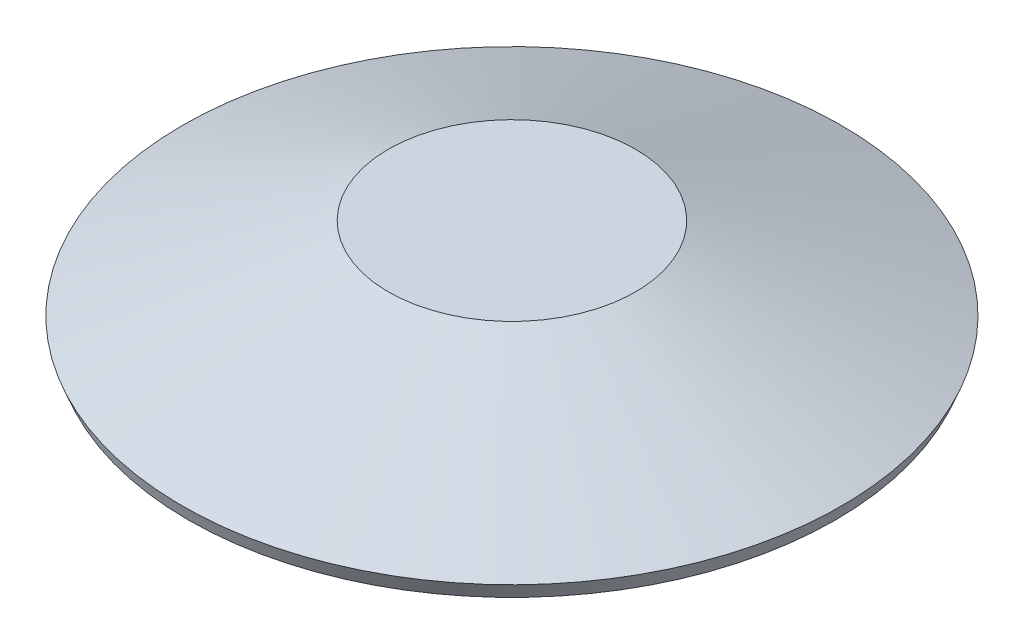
from build123d import *


with BuildPart() as part:
    # Sketch1 → Revolve1 (revolve)
    with BuildSketch(Plane.XY, mode=Mode.PRIVATE) as revolve1_sk:
        with BuildLine():
            Line((0, 1.6), (0, -3.7))
            Line((0, -3.7), (1, -3.7))
            Line((1, -3.7), (1, -3.3))
            Line((1, -3.3), (1.833080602, -2.662966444))
            ThreePointArc((1.833080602, -2.662966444), (1.955992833, -2.513580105), (2, -2.3252))
            ThreePointArc((2, -2.3252), (1.875461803, -2.024538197), (1.5748, -1.9))
            Line((1.5748, -1.9), (1.8669, 0))
            Line((1.8669, 0), (2.5, 0))
            Line((2.5, 0), (2.5, 0.5))
            Line((2.5, 0.5), (7.851443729, -0.771390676))
            Line((7.851443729, -0.771390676), (8, -0.4))
            Line((8, -0.4), (3, 1.6))
            Line((3, 1.6), (0, 1.6))
        make_face()
    revolve(revolve1_sk.sketch.rotate(Axis((0, -0.155918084, 0), (0, -1, 0)), 180), axis=Axis((0, -0.155918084, 0), (0, -1, 0)))


solid = part.part
